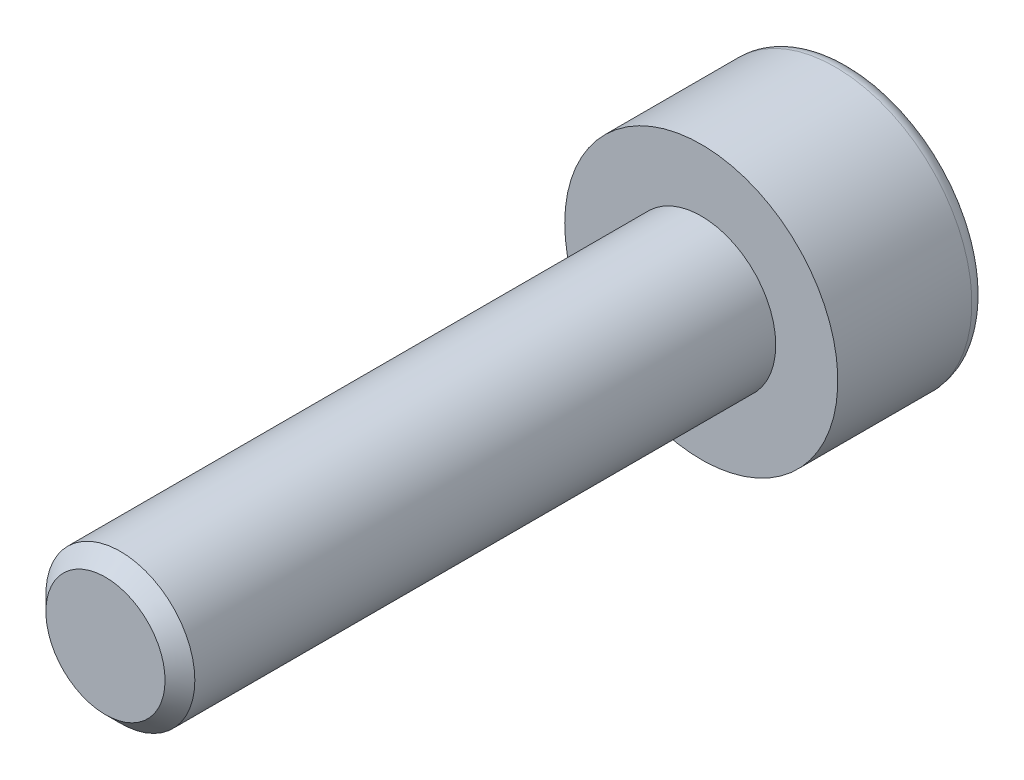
from build123d import *

# Parameters (mm, degrees)
ENLEV_MAT_EXTRU1_DEPTH = 1.3
ESQUISSE3_W            = 1.5
ESQUISSE3_H            = 12
CHANFREIN1_SIZE        = 0.3


with BuildPart() as part:
    # Esquisse1 → Base-R_volution (revolve)
    with BuildSketch(Plane(origin=(0, 0, 0), x_dir=(1, 0, 0), z_dir=(0, 1, 0)), mode=Mode.PRIVATE) as base_r_volution_sk:
        with BuildLine():
            Line((0, 0), (2.75, 0))
            Line((2.75, 0), (2.75, 2.7))
            ThreePointArc((2.75, 2.7), (2.662132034, 2.912132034), (2.45, 3))
            Line((2.45, 3), (0, 3))
            Line((0, 3), (0, 0))
        make_face()
    revolve(base_r_volution_sk.sketch.rotate(Axis((0, 0, 0), (0, 0, -1)), 180), axis=Axis((0, 0, 0), (0, 0, -1)))

    # Esquisse2 → enlev-mat-Extru1 (cut)
    with BuildSketch(Plane.XY.offset(-3)):
        Polygon((1.25, -0.721687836), (1.25, 0.721687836), (0, 1.443375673), (-1.25, 0.721687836), (-1.25, -0.721687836), (0, -1.443375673), align=None)
    extrude(amount=ENLEV_MAT_EXTRU1_DEPTH, mode=Mode.SUBTRACT)

    # Esquisse3 → Boss.-R_vol.1 (revolve)
    with BuildSketch(Plane(origin=(0, 0, 0), x_dir=(1, 0, 0), z_dir=(0, 1, 0))):
        with Locations((0.75, -6)):
            Rectangle(ESQUISSE3_W, ESQUISSE3_H)
    revolve(axis=Axis((0, 0, 0), (0, 0, 1)))

    # Chanfrein1
    chanfrein1_edges = [part.edges().sort_by_distance(p)[0] for p in [
        (-1.5, 0, 12),
    ]]
    chamfer(chanfrein1_edges, length=CHANFREIN1_SIZE)


solid = part.part
